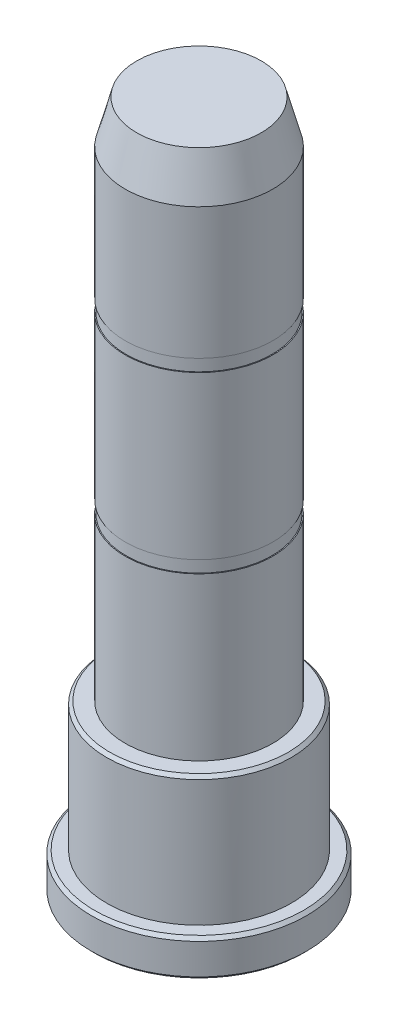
ISO-10303-21;
HEADER;
FILE_DESCRIPTION(('STEP AP214'),'2;1');
FILE_NAME('part.step','',(''),(''),'','','');
FILE_SCHEMA(('AUTOMOTIVE_DESIGN { 1 0 10303 214 1 1 1 1 }'));
ENDSEC;
DATA;
#1=APPLICATION_CONTEXT('core data for automotive mechanical design processes');
#2=APPLICATION_PROTOCOL_DEFINITION('international standard','automotive_design',2000,#1);
#3=PRODUCT_CONTEXT('',#1,'mechanical');
#4=PRODUCT('Part','Part','',(#3));
#5=PRODUCT_RELATED_PRODUCT_CATEGORY('part','',(#4));
#6=PRODUCT_DEFINITION_FORMATION('','',#4);
#7=PRODUCT_DEFINITION_CONTEXT('part definition',#1,'design');
#8=PRODUCT_DEFINITION('design','',#6,#7);
#9=PRODUCT_DEFINITION_SHAPE('','',#8);
#10=(LENGTH_UNIT() NAMED_UNIT(*) SI_UNIT(.MILLI.,.METRE.));
#11=(NAMED_UNIT(*) PLANE_ANGLE_UNIT() SI_UNIT($,.RADIAN.));
#12=(NAMED_UNIT(*) SI_UNIT($,.STERADIAN.) SOLID_ANGLE_UNIT());
#13=UNCERTAINTY_MEASURE_WITH_UNIT(LENGTH_MEASURE(1.E-05),#10,'distance_accuracy_value','');
#14=(GEOMETRIC_REPRESENTATION_CONTEXT(3) GLOBAL_UNCERTAINTY_ASSIGNED_CONTEXT((#13)) GLOBAL_UNIT_ASSIGNED_CONTEXT((#10,
#11,#12)) REPRESENTATION_CONTEXT('',''));
#15=CARTESIAN_POINT('',(0.,0.,0.));
#16=DIRECTION('',(0.,0.,1.));
#17=DIRECTION('',(1.,0.,0.));
#18=AXIS2_PLACEMENT_3D('',#15,#16,#17);
#19=CARTESIAN_POINT('',(-10.1243556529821,106.,0.));
#20=DIRECTION('',(0.,-1.,0.));
#21=DIRECTION('',(1.,0.,0.));
#22=AXIS2_PLACEMENT_3D('',#19,#20,#21);
#23=PLANE('',#22);
#24=CARTESIAN_POINT('',(0.,106.,0.));
#25=DIRECTION('',(0.,1.,0.));
#26=DIRECTION('',(-1.,0.,0.));
#27=AXIS2_PLACEMENT_3D('',#24,#25,#26);
#28=CIRCLE('',#27,10.1243556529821);
#29=CARTESIAN_POINT('',(-10.1243556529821,106.,0.));
#30=VERTEX_POINT('',#29);
#31=EDGE_CURVE('E50',#30,#30,#28,.T.);
#32=ORIENTED_EDGE('',*,*,#31,.T.);
#33=EDGE_LOOP('',(#32));
#34=FACE_BOUND('',#33,.T.);
#35=ADVANCED_FACE('F14',(#34),#23,.F.);
#36=CARTESIAN_POINT('',(0.,106.,0.));
#37=DIRECTION('',(0.,-1.,0.));
#38=DIRECTION('',(1.,0.,0.));
#39=AXIS2_PLACEMENT_3D('',#36,#37,#38);
#40=CONICAL_SURFACE('',#39,10.1243556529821,0.261799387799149);
#41=CARTESIAN_POINT('',(0.,99.,0.));
#42=DIRECTION('',(0.,1.,0.));
#43=DIRECTION('',(-1.,0.,0.));
#44=AXIS2_PLACEMENT_3D('',#41,#42,#43);
#45=CIRCLE('',#44,12.);
#46=CARTESIAN_POINT('',(-12.,99.,0.));
#47=VERTEX_POINT('',#46);
#48=EDGE_CURVE('E54',#47,#47,#45,.T.);
#49=ORIENTED_EDGE('',*,*,#48,.T.);
#50=EDGE_LOOP('',(#49));
#51=FACE_BOUND('',#50,.T.);
#52=ORIENTED_EDGE('',*,*,#31,.F.);
#53=EDGE_LOOP('',(#52));
#54=FACE_BOUND('',#53,.T.);
#55=ADVANCED_FACE('F113',(#51,#54),#40,.T.);
#56=CARTESIAN_POINT('',(0.,106.,0.));
#57=DIRECTION('',(0.,1.,0.));
#58=DIRECTION('',(-1.,0.,0.));
#59=AXIS2_PLACEMENT_3D('',#56,#57,#58);
#60=CYLINDRICAL_SURFACE('',#59,12.);
#61=ORIENTED_EDGE('',*,*,#48,.F.);
#62=EDGE_LOOP('',(#61));
#63=FACE_BOUND('',#62,.T.);
#64=CARTESIAN_POINT('',(0.,77.6666666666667,0.));
#65=DIRECTION('',(0.,1.,0.));
#66=DIRECTION('',(-1.,0.,0.));
#67=AXIS2_PLACEMENT_3D('',#64,#65,#66);
#68=CIRCLE('',#67,12.);
#69=CARTESIAN_POINT('',(-12.,77.6666666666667,0.));
#70=VERTEX_POINT('',#69);
#71=EDGE_CURVE('E58',#70,#70,#68,.T.);
#72=ORIENTED_EDGE('',*,*,#71,.T.);
#73=EDGE_LOOP('',(#72));
#74=FACE_BOUND('',#73,.T.);
#75=ADVANCED_FACE('F118',(#63,#74),#60,.T.);
#76=CARTESIAN_POINT('',(-11.85,77.6666666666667,0.));
#77=DIRECTION('',(0.,1.,0.));
#78=DIRECTION('',(-1.,0.,0.));
#79=AXIS2_PLACEMENT_3D('',#76,#77,#78);
#80=PLANE('',#79);
#81=ORIENTED_EDGE('',*,*,#71,.F.);
#82=EDGE_LOOP('',(#81));
#83=FACE_BOUND('',#82,.T.);
#84=CARTESIAN_POINT('',(0.,77.6666666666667,0.));
#85=DIRECTION('',(0.,1.,0.));
#86=DIRECTION('',(-1.,0.,0.));
#87=AXIS2_PLACEMENT_3D('',#84,#85,#86);
#88=CIRCLE('',#87,11.85);
#89=CARTESIAN_POINT('',(-11.85,77.6666666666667,0.));
#90=VERTEX_POINT('',#89);
#91=EDGE_CURVE('E62',#90,#90,#88,.T.);
#92=ORIENTED_EDGE('',*,*,#91,.T.);
#93=EDGE_LOOP('',(#92));
#94=FACE_BOUND('',#93,.T.);
#95=ADVANCED_FACE('F263',(#83,#94),#80,.F.);
#96=CARTESIAN_POINT('',(0.,106.,0.));
#97=DIRECTION('',(0.,1.,0.));
#98=DIRECTION('',(-1.,0.,0.));
#99=AXIS2_PLACEMENT_3D('',#96,#97,#98);
#100=CYLINDRICAL_SURFACE('',#99,11.85);
#101=ORIENTED_EDGE('',*,*,#91,.F.);
#102=EDGE_LOOP('',(#101));
#103=FACE_BOUND('',#102,.T.);
#104=CARTESIAN_POINT('',(0.,75.6666666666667,0.));
#105=DIRECTION('',(0.,1.,0.));
#106=DIRECTION('',(-1.,0.,0.));
#107=AXIS2_PLACEMENT_3D('',#104,#105,#106);
#108=CIRCLE('',#107,11.85);
#109=CARTESIAN_POINT('',(-11.85,75.6666666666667,0.));
#110=VERTEX_POINT('',#109);
#111=EDGE_CURVE('E66',#110,#110,#108,.T.);
#112=ORIENTED_EDGE('',*,*,#111,.T.);
#113=EDGE_LOOP('',(#112));
#114=FACE_BOUND('',#113,.T.);
#115=ADVANCED_FACE('F253',(#103,#114),#100,.T.);
#116=CARTESIAN_POINT('',(-12.,75.6666666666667,0.));
#117=DIRECTION('',(0.,-1.,0.));
#118=DIRECTION('',(1.,0.,0.));
#119=AXIS2_PLACEMENT_3D('',#116,#117,#118);
#120=PLANE('',#119);
#121=ORIENTED_EDGE('',*,*,#111,.F.);
#122=EDGE_LOOP('',(#121));
#123=FACE_BOUND('',#122,.T.);
#124=CARTESIAN_POINT('',(0.,75.6666666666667,0.));
#125=DIRECTION('',(0.,1.,0.));
#126=DIRECTION('',(-1.,0.,0.));
#127=AXIS2_PLACEMENT_3D('',#124,#125,#126);
#128=CIRCLE('',#127,12.);
#129=CARTESIAN_POINT('',(-12.,75.6666666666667,0.));
#130=VERTEX_POINT('',#129);
#131=EDGE_CURVE('E70',#130,#130,#128,.T.);
#132=ORIENTED_EDGE('',*,*,#131,.T.);
#133=EDGE_LOOP('',(#132));
#134=FACE_BOUND('',#133,.T.);
#135=ADVANCED_FACE('F243',(#123,#134),#120,.F.);
#136=CARTESIAN_POINT('',(0.,106.,0.));
#137=DIRECTION('',(0.,1.,0.));
#138=DIRECTION('',(-1.,0.,0.));
#139=AXIS2_PLACEMENT_3D('',#136,#137,#138);
#140=CYLINDRICAL_SURFACE('',#139,12.);
#141=ORIENTED_EDGE('',*,*,#131,.F.);
#142=EDGE_LOOP('',(#141));
#143=FACE_BOUND('',#142,.T.);
#144=CARTESIAN_POINT('',(0.,49.3333333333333,0.));
#145=DIRECTION('',(0.,1.,0.));
#146=DIRECTION('',(-1.,0.,0.));
#147=AXIS2_PLACEMENT_3D('',#144,#145,#146);
#148=CIRCLE('',#147,12.);
#149=CARTESIAN_POINT('',(-12.,49.3333333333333,0.));
#150=VERTEX_POINT('',#149);
#151=EDGE_CURVE('E74',#150,#150,#148,.T.);
#152=ORIENTED_EDGE('',*,*,#151,.T.);
#153=EDGE_LOOP('',(#152));
#154=FACE_BOUND('',#153,.T.);
#155=ADVANCED_FACE('F233',(#143,#154),#140,.T.);
#156=CARTESIAN_POINT('',(-11.85,49.3333333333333,0.));
#157=DIRECTION('',(0.,1.,0.));
#158=DIRECTION('',(-1.,0.,0.));
#159=AXIS2_PLACEMENT_3D('',#156,#157,#158);
#160=PLANE('',#159);
#161=ORIENTED_EDGE('',*,*,#151,.F.);
#162=EDGE_LOOP('',(#161));
#163=FACE_BOUND('',#162,.T.);
#164=CARTESIAN_POINT('',(0.,49.3333333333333,0.));
#165=DIRECTION('',(0.,1.,0.));
#166=DIRECTION('',(-1.,0.,0.));
#167=AXIS2_PLACEMENT_3D('',#164,#165,#166);
#168=CIRCLE('',#167,11.85);
#169=CARTESIAN_POINT('',(-11.85,49.3333333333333,0.));
#170=VERTEX_POINT('',#169);
#171=EDGE_CURVE('E77',#170,#170,#168,.T.);
#172=ORIENTED_EDGE('',*,*,#171,.T.);
#173=EDGE_LOOP('',(#172));
#174=FACE_BOUND('',#173,.T.);
#175=ADVANCED_FACE('F223',(#163,#174),#160,.F.);
#176=CARTESIAN_POINT('',(0.,106.,0.));
#177=DIRECTION('',(0.,1.,0.));
#178=DIRECTION('',(-1.,0.,0.));
#179=AXIS2_PLACEMENT_3D('',#176,#177,#178);
#180=CYLINDRICAL_SURFACE('',#179,11.85);
#181=ORIENTED_EDGE('',*,*,#171,.F.);
#182=EDGE_LOOP('',(#181));
#183=FACE_BOUND('',#182,.T.);
#184=CARTESIAN_POINT('',(0.,47.3333333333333,0.));
#185=DIRECTION('',(0.,1.,0.));
#186=DIRECTION('',(-1.,0.,0.));
#187=AXIS2_PLACEMENT_3D('',#184,#185,#186);
#188=CIRCLE('',#187,11.85);
#189=CARTESIAN_POINT('',(-11.85,47.3333333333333,0.));
#190=VERTEX_POINT('',#189);
#191=EDGE_CURVE('E80',#190,#190,#188,.T.);
#192=ORIENTED_EDGE('',*,*,#191,.T.);
#193=EDGE_LOOP('',(#192));
#194=FACE_BOUND('',#193,.T.);
#195=ADVANCED_FACE('F213',(#183,#194),#180,.T.);
#196=CARTESIAN_POINT('',(-12.,47.3333333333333,0.));
#197=DIRECTION('',(0.,-1.,0.));
#198=DIRECTION('',(1.,0.,0.));
#199=AXIS2_PLACEMENT_3D('',#196,#197,#198);
#200=PLANE('',#199);
#201=ORIENTED_EDGE('',*,*,#191,.F.);
#202=EDGE_LOOP('',(#201));
#203=FACE_BOUND('',#202,.T.);
#204=CARTESIAN_POINT('',(0.,47.3333333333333,0.));
#205=DIRECTION('',(0.,1.,0.));
#206=DIRECTION('',(-1.,0.,0.));
#207=AXIS2_PLACEMENT_3D('',#204,#205,#206);
#208=CIRCLE('',#207,12.);
#209=CARTESIAN_POINT('',(-12.,47.3333333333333,0.));
#210=VERTEX_POINT('',#209);
#211=EDGE_CURVE('E84',#210,#210,#208,.T.);
#212=ORIENTED_EDGE('',*,*,#211,.T.);
#213=EDGE_LOOP('',(#212));
#214=FACE_BOUND('',#213,.T.);
#215=ADVANCED_FACE('F203',(#203,#214),#200,.F.);
#216=CARTESIAN_POINT('',(0.,106.,0.));
#217=DIRECTION('',(0.,1.,0.));
#218=DIRECTION('',(-1.,0.,0.));
#219=AXIS2_PLACEMENT_3D('',#216,#217,#218);
#220=CYLINDRICAL_SURFACE('',#219,12.);
#221=ORIENTED_EDGE('',*,*,#211,.F.);
#222=EDGE_LOOP('',(#221));
#223=FACE_BOUND('',#222,.T.);
#224=CARTESIAN_POINT('',(0.,21.,0.));
#225=DIRECTION('',(0.,1.,0.));
#226=DIRECTION('',(-1.,0.,0.));
#227=AXIS2_PLACEMENT_3D('',#224,#225,#226);
#228=CIRCLE('',#227,12.);
#229=CARTESIAN_POINT('',(-12.,21.,0.));
#230=VERTEX_POINT('',#229);
#231=EDGE_CURVE('E88',#230,#230,#228,.T.);
#232=ORIENTED_EDGE('',*,*,#231,.T.);
#233=EDGE_LOOP('',(#232));
#234=FACE_BOUND('',#233,.T.);
#235=ADVANCED_FACE('F193',(#223,#234),#220,.T.);
#236=CARTESIAN_POINT('',(-15.,21.,0.));
#237=DIRECTION('',(0.,-1.,0.));
#238=DIRECTION('',(1.,0.,0.));
#239=AXIS2_PLACEMENT_3D('',#236,#237,#238);
#240=PLANE('',#239);
#241=CARTESIAN_POINT('',(0.,21.,0.));
#242=DIRECTION('',(0.,-1.,0.));
#243=DIRECTION('',(1.,0.,0.));
#244=AXIS2_PLACEMENT_3D('',#241,#242,#243);
#245=CIRCLE('',#244,14.5);
#246=CARTESIAN_POINT('',(14.5,21.,0.));
#247=VERTEX_POINT('',#246);
#248=EDGE_CURVE('E47',#247,#247,#245,.F.);
#249=ORIENTED_EDGE('',*,*,#248,.T.);
#250=EDGE_LOOP('',(#249));
#251=FACE_BOUND('',#250,.T.);
#252=ORIENTED_EDGE('',*,*,#231,.F.);
#253=EDGE_LOOP('',(#252));
#254=FACE_BOUND('',#253,.T.);
#255=ADVANCED_FACE('F109',(#251,#254),#240,.F.);
#256=CARTESIAN_POINT('',(0.,106.,0.));
#257=DIRECTION('',(0.,1.,0.));
#258=DIRECTION('',(-1.,0.,0.));
#259=AXIS2_PLACEMENT_3D('',#256,#257,#258);
#260=CYLINDRICAL_SURFACE('',#259,15.);
#261=CARTESIAN_POINT('',(0.,20.5,0.));
#262=DIRECTION('',(0.,-1.,0.));
#263=DIRECTION('',(1.,0.,0.));
#264=AXIS2_PLACEMENT_3D('',#261,#262,#263);
#265=CIRCLE('',#264,15.);
#266=CARTESIAN_POINT('',(15.,20.5,0.));
#267=VERTEX_POINT('',#266);
#268=EDGE_CURVE('E43',#267,#267,#265,.T.);
#269=ORIENTED_EDGE('',*,*,#268,.T.);
#270=EDGE_LOOP('',(#269));
#271=FACE_BOUND('',#270,.T.);
#272=CARTESIAN_POINT('',(0.,0.,0.));
#273=DIRECTION('',(0.,1.,0.));
#274=DIRECTION('',(-1.,0.,0.));
#275=AXIS2_PLACEMENT_3D('',#272,#273,#274);
#276=CIRCLE('',#275,15.);
#277=CARTESIAN_POINT('',(-15.,0.,0.));
#278=VERTEX_POINT('',#277);
#279=EDGE_CURVE('E92',#278,#278,#276,.T.);
#280=ORIENTED_EDGE('',*,*,#279,.T.);
#281=EDGE_LOOP('',(#280));
#282=FACE_BOUND('',#281,.T.);
#283=ADVANCED_FACE('F96',(#271,#282),#260,.T.);
#284=CARTESIAN_POINT('',(-17.5,0.,0.));
#285=DIRECTION('',(0.,-1.,0.));
#286=DIRECTION('',(1.,0.,0.));
#287=AXIS2_PLACEMENT_3D('',#284,#285,#286);
#288=PLANE('',#287);
#289=CARTESIAN_POINT('',(0.,0.,0.));
#290=DIRECTION('',(0.,-1.,0.));
#291=DIRECTION('',(1.,0.,0.));
#292=AXIS2_PLACEMENT_3D('',#289,#290,#291);
#293=CIRCLE('',#292,17.);
#294=CARTESIAN_POINT('',(17.,0.,0.));
#295=VERTEX_POINT('',#294);
#296=EDGE_CURVE('E37',#295,#295,#293,.F.);
#297=ORIENTED_EDGE('',*,*,#296,.T.);
#298=EDGE_LOOP('',(#297));
#299=FACE_BOUND('',#298,.T.);
#300=ORIENTED_EDGE('',*,*,#279,.F.);
#301=EDGE_LOOP('',(#300));
#302=FACE_BOUND('',#301,.T.);
#303=ADVANCED_FACE('F98',(#299,#302),#288,.F.);
#304=CARTESIAN_POINT('',(0.,106.,0.));
#305=DIRECTION('',(0.,1.,0.));
#306=DIRECTION('',(-1.,0.,0.));
#307=AXIS2_PLACEMENT_3D('',#304,#305,#306);
#308=CYLINDRICAL_SURFACE('',#307,17.5);
#309=CARTESIAN_POINT('',(0.,-0.500000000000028,0.));
#310=DIRECTION('',(0.,-1.,0.));
#311=DIRECTION('',(1.,0.,0.));
#312=AXIS2_PLACEMENT_3D('',#309,#310,#311);
#313=CIRCLE('',#312,17.5);
#314=CARTESIAN_POINT('',(17.5,-0.500000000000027,0.));
#315=VERTEX_POINT('',#314);
#316=EDGE_CURVE('E22',#315,#315,#313,.T.);
#317=ORIENTED_EDGE('',*,*,#316,.T.);
#318=EDGE_LOOP('',(#317));
#319=FACE_BOUND('',#318,.T.);
#320=CARTESIAN_POINT('',(0.,-5.5,0.));
#321=DIRECTION('',(0.,1.,0.));
#322=DIRECTION('',(-1.,0.,0.));
#323=AXIS2_PLACEMENT_3D('',#320,#321,#322);
#324=CIRCLE('',#323,17.5);
#325=CARTESIAN_POINT('',(-17.5,-5.5,0.));
#326=VERTEX_POINT('',#325);
#327=EDGE_CURVE('E30',#326,#326,#324,.T.);
#328=ORIENTED_EDGE('',*,*,#327,.T.);
#329=EDGE_LOOP('',(#328));
#330=FACE_BOUND('',#329,.T.);
#331=ADVANCED_FACE('F100',(#319,#330),#308,.T.);
#332=CARTESIAN_POINT('',(0.,-6.,0.));
#333=DIRECTION('',(0.,1.,0.));
#334=DIRECTION('',(-1.,0.,0.));
#335=AXIS2_PLACEMENT_3D('',#332,#333,#334);
#336=PLANE('',#335);
#337=CARTESIAN_POINT('',(0.,-6.,0.));
#338=DIRECTION('',(0.,1.,0.));
#339=DIRECTION('',(-1.,0.,0.));
#340=AXIS2_PLACEMENT_3D('',#337,#338,#339);
#341=CIRCLE('',#340,17.);
#342=CARTESIAN_POINT('',(-17.,-6.,0.));
#343=VERTEX_POINT('',#342);
#344=EDGE_CURVE('E9',#343,#343,#341,.F.);
#345=ORIENTED_EDGE('',*,*,#344,.T.);
#346=EDGE_LOOP('',(#345));
#347=FACE_BOUND('',#346,.T.);
#348=ADVANCED_FACE('F107',(#347),#336,.F.);
#349=CARTESIAN_POINT('',(0.,21.,0.));
#350=DIRECTION('',(0.,-1.,0.));
#351=DIRECTION('',(1.,0.,0.));
#352=AXIS2_PLACEMENT_3D('',#349,#350,#351);
#353=CONICAL_SURFACE('',#352,14.5,0.785398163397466);
#354=ORIENTED_EDGE('',*,*,#268,.F.);
#355=EDGE_LOOP('',(#354));
#356=FACE_BOUND('',#355,.T.);
#357=ORIENTED_EDGE('',*,*,#248,.F.);
#358=EDGE_LOOP('',(#357));
#359=FACE_BOUND('',#358,.T.);
#360=ADVANCED_FACE('F123',(#356,#359),#353,.T.);
#361=CARTESIAN_POINT('',(0.,0.,0.));
#362=DIRECTION('',(0.,-1.,0.));
#363=DIRECTION('',(1.,0.,0.));
#364=AXIS2_PLACEMENT_3D('',#361,#362,#363);
#365=CONICAL_SURFACE('',#364,17.,0.785398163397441);
#366=ORIENTED_EDGE('',*,*,#316,.F.);
#367=EDGE_LOOP('',(#366));
#368=FACE_BOUND('',#367,.T.);
#369=ORIENTED_EDGE('',*,*,#296,.F.);
#370=EDGE_LOOP('',(#369));
#371=FACE_BOUND('',#370,.T.);
#372=ADVANCED_FACE('F125',(#368,#371),#365,.T.);
#373=CARTESIAN_POINT('',(0.,-5.5,0.));
#374=DIRECTION('',(0.,1.,0.));
#375=DIRECTION('',(-1.,0.,0.));
#376=AXIS2_PLACEMENT_3D('',#373,#374,#375);
#377=CONICAL_SURFACE('',#376,17.5,0.785398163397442);
#378=ORIENTED_EDGE('',*,*,#344,.F.);
#379=EDGE_LOOP('',(#378));
#380=FACE_BOUND('',#379,.T.);
#381=ORIENTED_EDGE('',*,*,#327,.F.);
#382=EDGE_LOOP('',(#381));
#383=FACE_BOUND('',#382,.T.);
#384=ADVANCED_FACE('F16',(#380,#383),#377,.T.);
#385=CLOSED_SHELL('',(#35,#55,#75,#95,#115,#135,#155,#175,#195,#215,#235,#255,#283,#303,#331,
#348,#360,#372,#384));
#386=MANIFOLD_SOLID_BREP('B1',#385);
#387=ADVANCED_BREP_SHAPE_REPRESENTATION('',(#18,#386),#14);
#388=SHAPE_DEFINITION_REPRESENTATION(#9,#387);
ENDSEC;
END-ISO-10303-21;
